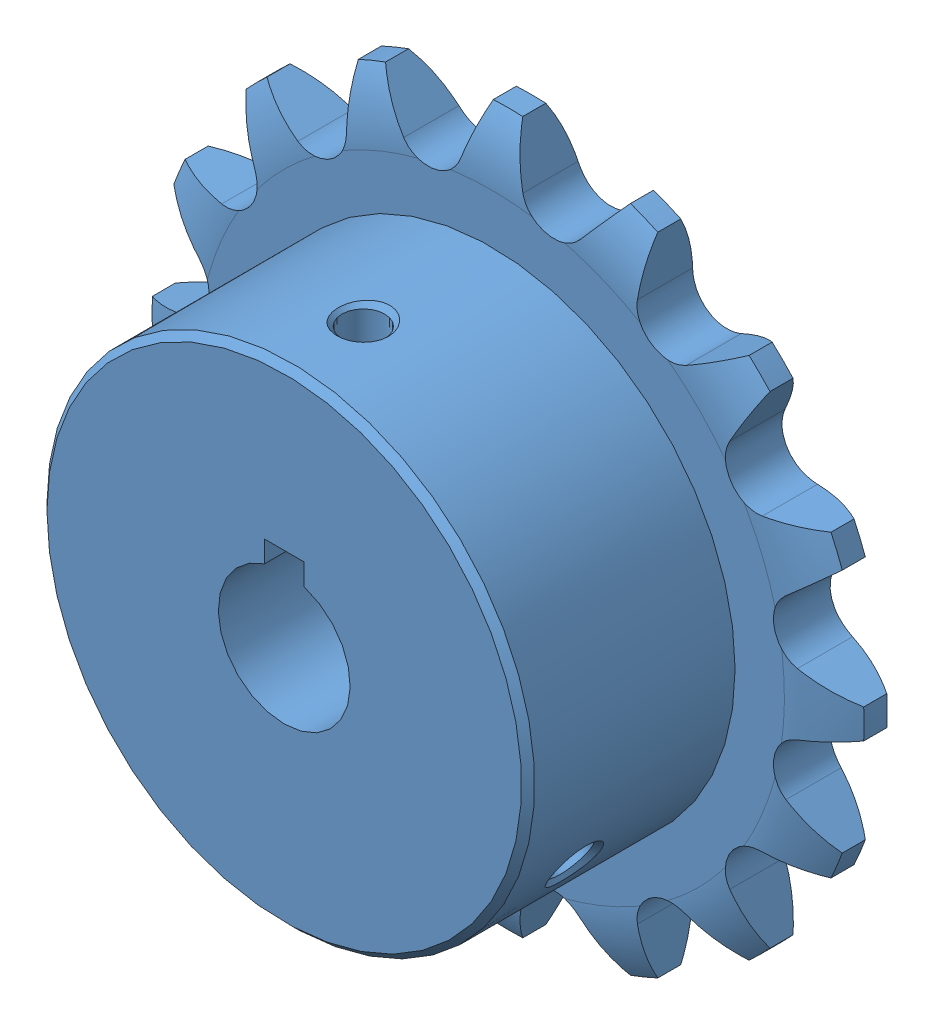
SolidWorks assembly SP35B16-N-10.SLDASM, configuration Default (file format 12000). Lengths in mm.
Overall size (54 54 20.78).
3 component instances, 2 part files, 0 mates.
Components (placement in the parent):
- _SP35B16-N-10_b_1-1: _SP35B16-N-10_b_1.sldprt [Default] at origin size (54 54 20.78)
- _SET-SCREW4-4_1-1: _SET-SCREW4-4_1.sldprt [Default] at (0 6.4 14) x (0 -1 0) z (-1 0 0) size (4 4 4)
- _SET-SCREW4-4_1-2: _SET-SCREW4-4_1.sldprt [Default] at (4.3301 -2.5 14) x (-0.866025 0.5 0) z (0.5 0.866025 0) size (4 4 4)
